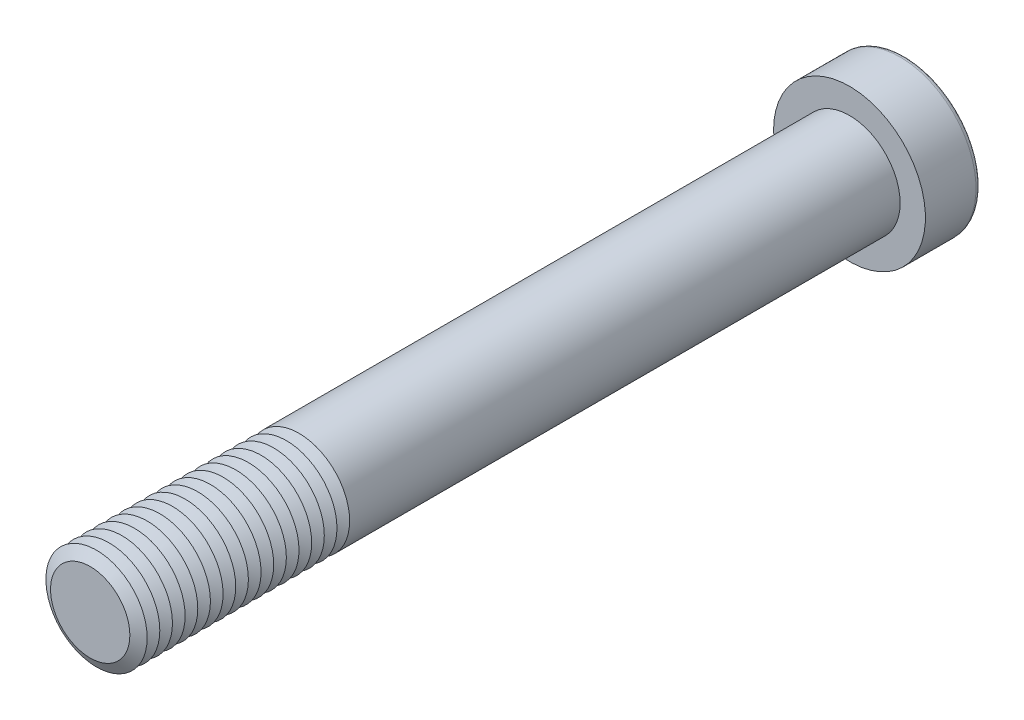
ISO-10303-21;
HEADER;
FILE_DESCRIPTION(('STEP AP214'),'2;1');
FILE_NAME('part.step','',(''),(''),'','','');
FILE_SCHEMA(('AUTOMOTIVE_DESIGN { 1 0 10303 214 1 1 1 1 }'));
ENDSEC;
DATA;
#1=APPLICATION_CONTEXT('core data for automotive mechanical design processes');
#2=APPLICATION_PROTOCOL_DEFINITION('international standard','automotive_design',2000,#1);
#3=PRODUCT_CONTEXT('',#1,'mechanical');
#4=PRODUCT('Part','Part','',(#3));
#5=PRODUCT_RELATED_PRODUCT_CATEGORY('part','',(#4));
#6=PRODUCT_DEFINITION_FORMATION('','',#4);
#7=PRODUCT_DEFINITION_CONTEXT('part definition',#1,'design');
#8=PRODUCT_DEFINITION('design','',#6,#7);
#9=PRODUCT_DEFINITION_SHAPE('','',#8);
#10=(LENGTH_UNIT() NAMED_UNIT(*) SI_UNIT(.MILLI.,.METRE.));
#11=(NAMED_UNIT(*) PLANE_ANGLE_UNIT() SI_UNIT($,.RADIAN.));
#12=(NAMED_UNIT(*) SI_UNIT($,.STERADIAN.) SOLID_ANGLE_UNIT());
#13=UNCERTAINTY_MEASURE_WITH_UNIT(LENGTH_MEASURE(1.E-05),#10,'distance_accuracy_value','');
#14=(GEOMETRIC_REPRESENTATION_CONTEXT(3) GLOBAL_UNCERTAINTY_ASSIGNED_CONTEXT((#13)) GLOBAL_UNIT_ASSIGNED_CONTEXT((#10,
#11,#12)) REPRESENTATION_CONTEXT('',''));
#15=CARTESIAN_POINT('',(0.,0.,0.));
#16=DIRECTION('',(0.,0.,1.));
#17=DIRECTION('',(1.,0.,0.));
#18=AXIS2_PLACEMENT_3D('',#15,#16,#17);
#19=CARTESIAN_POINT('',(0.,0.,141.25));
#20=DIRECTION('',(0.,0.,1.));
#21=DIRECTION('',(1.,0.,0.));
#22=AXIS2_PLACEMENT_3D('',#19,#20,#21);
#23=CONICAL_SURFACE('',#22,10.,1.0471975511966);
#24=CARTESIAN_POINT('',(0.,0.,140.));
#25=DIRECTION('',(0.,0.,1.));
#26=DIRECTION('',(1.,0.,0.));
#27=AXIS2_PLACEMENT_3D('',#24,#25,#26);
#28=CIRCLE('',#27,7.8349364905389);
#29=CARTESIAN_POINT('',(7.8349364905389,0.,140.));
#30=VERTEX_POINT('',#29);
#31=EDGE_CURVE('E314',#30,#30,#28,.T.);
#32=ORIENTED_EDGE('',*,*,#31,.T.);
#33=EDGE_LOOP('',(#32));
#34=FACE_BOUND('',#33,.T.);
#35=CARTESIAN_POINT('',(0.,0.,141.25));
#36=DIRECTION('',(0.,0.,1.));
#37=DIRECTION('',(1.,0.,0.));
#38=AXIS2_PLACEMENT_3D('',#35,#36,#37);
#39=CIRCLE('',#38,10.);
#40=CARTESIAN_POINT('',(10.,0.,141.25));
#41=VERTEX_POINT('',#40);
#42=EDGE_CURVE('E317',#41,#41,#39,.T.);
#43=ORIENTED_EDGE('',*,*,#42,.F.);
#44=EDGE_LOOP('',(#43));
#45=FACE_BOUND('',#44,.T.);
#46=ADVANCED_FACE('F39',(#34,#45),#23,.T.);
#47=CARTESIAN_POINT('',(0.,0.,140.));
#48=DIRECTION('',(0.,0.,-1.));
#49=DIRECTION('',(-1.,0.,0.));
#50=AXIS2_PLACEMENT_3D('',#47,#48,#49);
#51=CONICAL_SURFACE('',#50,7.8349364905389,1.0471975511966);
#52=CARTESIAN_POINT('',(0.,0.,138.75));
#53=DIRECTION('',(0.,0.,1.));
#54=DIRECTION('',(1.,0.,0.));
#55=AXIS2_PLACEMENT_3D('',#52,#53,#54);
#56=CIRCLE('',#55,10.);
#57=CARTESIAN_POINT('',(10.,0.,138.75));
#58=VERTEX_POINT('',#57);
#59=EDGE_CURVE('E325',#58,#58,#56,.T.);
#60=ORIENTED_EDGE('',*,*,#59,.T.);
#61=EDGE_LOOP('',(#60));
#62=FACE_BOUND('',#61,.T.);
#63=ORIENTED_EDGE('',*,*,#31,.F.);
#64=EDGE_LOOP('',(#63));
#65=FACE_BOUND('',#64,.T.);
#66=ADVANCED_FACE('F245',(#62,#65),#51,.T.);
#67=CARTESIAN_POINT('',(0.,0.,150.));
#68=DIRECTION('',(0.,0.,1.));
#69=DIRECTION('',(1.,0.,0.));
#70=AXIS2_PLACEMENT_3D('',#67,#68,#69);
#71=PLANE('',#70);
#72=CARTESIAN_POINT('',(0.,0.,150.));
#73=DIRECTION('',(0.,0.,1.));
#74=DIRECTION('',(1.,0.,0.));
#75=AXIS2_PLACEMENT_3D('',#72,#73,#74);
#76=CIRCLE('',#75,7.8349364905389);
#77=CARTESIAN_POINT('',(7.8349364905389,0.,150.));
#78=VERTEX_POINT('',#77);
#79=EDGE_CURVE('E174',#78,#78,#76,.T.);
#80=ORIENTED_EDGE('',*,*,#79,.T.);
#81=EDGE_LOOP('',(#80));
#82=FACE_BOUND('',#81,.T.);
#83=ADVANCED_FACE('F251',(#82),#71,.T.);
#84=CARTESIAN_POINT('',(0.,0.,150.));
#85=DIRECTION('',(0.,0.,-1.));
#86=DIRECTION('',(-1.,0.,0.));
#87=AXIS2_PLACEMENT_3D('',#84,#85,#86);
#88=CONICAL_SURFACE('',#87,7.8349364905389,1.0471975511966);
#89=CARTESIAN_POINT('',(0.,0.,148.75));
#90=DIRECTION('',(0.,0.,1.));
#91=DIRECTION('',(1.,0.,0.));
#92=AXIS2_PLACEMENT_3D('',#89,#90,#91);
#93=CIRCLE('',#92,10.);
#94=CARTESIAN_POINT('',(10.,0.,148.75));
#95=VERTEX_POINT('',#94);
#96=EDGE_CURVE('E291',#95,#95,#93,.T.);
#97=ORIENTED_EDGE('',*,*,#96,.T.);
#98=EDGE_LOOP('',(#97));
#99=FACE_BOUND('',#98,.T.);
#100=ORIENTED_EDGE('',*,*,#79,.F.);
#101=EDGE_LOOP('',(#100));
#102=FACE_BOUND('',#101,.T.);
#103=ADVANCED_FACE('F199',(#99,#102),#88,.T.);
#104=CARTESIAN_POINT('',(0.,0.,148.75));
#105=DIRECTION('',(0.,0.,1.));
#106=DIRECTION('',(1.,0.,0.));
#107=AXIS2_PLACEMENT_3D('',#104,#105,#106);
#108=CONICAL_SURFACE('',#107,10.,1.0471975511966);
#109=CARTESIAN_POINT('',(0.,0.,147.5));
#110=DIRECTION('',(0.,0.,1.));
#111=DIRECTION('',(1.,0.,0.));
#112=AXIS2_PLACEMENT_3D('',#109,#110,#111);
#113=CIRCLE('',#112,7.8349364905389);
#114=CARTESIAN_POINT('',(7.8349364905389,0.,147.5));
#115=VERTEX_POINT('',#114);
#116=EDGE_CURVE('E288',#115,#115,#113,.T.);
#117=ORIENTED_EDGE('',*,*,#116,.T.);
#118=EDGE_LOOP('',(#117));
#119=FACE_BOUND('',#118,.T.);
#120=ORIENTED_EDGE('',*,*,#96,.F.);
#121=EDGE_LOOP('',(#120));
#122=FACE_BOUND('',#121,.T.);
#123=ADVANCED_FACE('F277',(#119,#122),#108,.T.);
#124=CARTESIAN_POINT('',(0.,0.,147.5));
#125=DIRECTION('',(0.,0.,-1.));
#126=DIRECTION('',(-1.,0.,0.));
#127=AXIS2_PLACEMENT_3D('',#124,#125,#126);
#128=CONICAL_SURFACE('',#127,7.8349364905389,1.0471975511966);
#129=CARTESIAN_POINT('',(0.,0.,146.25));
#130=DIRECTION('',(0.,0.,1.));
#131=DIRECTION('',(1.,0.,0.));
#132=AXIS2_PLACEMENT_3D('',#129,#130,#131);
#133=CIRCLE('',#132,10.);
#134=CARTESIAN_POINT('',(10.,0.,146.25));
#135=VERTEX_POINT('',#134);
#136=EDGE_CURVE('E300',#135,#135,#133,.T.);
#137=ORIENTED_EDGE('',*,*,#136,.T.);
#138=EDGE_LOOP('',(#137));
#139=FACE_BOUND('',#138,.T.);
#140=ORIENTED_EDGE('',*,*,#116,.F.);
#141=EDGE_LOOP('',(#140));
#142=FACE_BOUND('',#141,.T.);
#143=ADVANCED_FACE('F274',(#139,#142),#128,.T.);
#144=CARTESIAN_POINT('',(0.,0.,146.25));
#145=DIRECTION('',(0.,0.,1.));
#146=DIRECTION('',(1.,0.,0.));
#147=AXIS2_PLACEMENT_3D('',#144,#145,#146);
#148=CONICAL_SURFACE('',#147,10.,1.0471975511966);
#149=CARTESIAN_POINT('',(0.,0.,145.));
#150=DIRECTION('',(0.,0.,1.));
#151=DIRECTION('',(1.,0.,0.));
#152=AXIS2_PLACEMENT_3D('',#149,#150,#151);
#153=CIRCLE('',#152,7.8349364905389);
#154=CARTESIAN_POINT('',(7.8349364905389,0.,145.));
#155=VERTEX_POINT('',#154);
#156=EDGE_CURVE('E293',#155,#155,#153,.T.);
#157=ORIENTED_EDGE('',*,*,#156,.T.);
#158=EDGE_LOOP('',(#157));
#159=FACE_BOUND('',#158,.T.);
#160=ORIENTED_EDGE('',*,*,#136,.F.);
#161=EDGE_LOOP('',(#160));
#162=FACE_BOUND('',#161,.T.);
#163=ADVANCED_FACE('F270',(#159,#162),#148,.T.);
#164=CARTESIAN_POINT('',(0.,0.,145.));
#165=DIRECTION('',(0.,0.,-1.));
#166=DIRECTION('',(-1.,0.,0.));
#167=AXIS2_PLACEMENT_3D('',#164,#165,#166);
#168=CONICAL_SURFACE('',#167,7.8349364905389,1.0471975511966);
#169=CARTESIAN_POINT('',(0.,0.,143.75));
#170=DIRECTION('',(0.,0.,1.));
#171=DIRECTION('',(1.,0.,0.));
#172=AXIS2_PLACEMENT_3D('',#169,#170,#171);
#173=CIRCLE('',#172,10.);
#174=CARTESIAN_POINT('',(10.,0.,143.75));
#175=VERTEX_POINT('',#174);
#176=EDGE_CURVE('E310',#175,#175,#173,.T.);
#177=ORIENTED_EDGE('',*,*,#176,.T.);
#178=EDGE_LOOP('',(#177));
#179=FACE_BOUND('',#178,.T.);
#180=ORIENTED_EDGE('',*,*,#156,.F.);
#181=EDGE_LOOP('',(#180));
#182=FACE_BOUND('',#181,.T.);
#183=ADVANCED_FACE('F266',(#179,#182),#168,.T.);
#184=CARTESIAN_POINT('',(0.,0.,143.75));
#185=DIRECTION('',(0.,0.,1.));
#186=DIRECTION('',(1.,0.,0.));
#187=AXIS2_PLACEMENT_3D('',#184,#185,#186);
#188=CONICAL_SURFACE('',#187,10.,1.0471975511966);
#189=CARTESIAN_POINT('',(0.,0.,142.5));
#190=DIRECTION('',(0.,0.,1.));
#191=DIRECTION('',(1.,0.,0.));
#192=AXIS2_PLACEMENT_3D('',#189,#190,#191);
#193=CIRCLE('',#192,7.8349364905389);
#194=CARTESIAN_POINT('',(7.8349364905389,0.,142.5));
#195=VERTEX_POINT('',#194);
#196=EDGE_CURVE('E306',#195,#195,#193,.T.);
#197=ORIENTED_EDGE('',*,*,#196,.T.);
#198=EDGE_LOOP('',(#197));
#199=FACE_BOUND('',#198,.T.);
#200=ORIENTED_EDGE('',*,*,#176,.F.);
#201=EDGE_LOOP('',(#200));
#202=FACE_BOUND('',#201,.T.);
#203=ADVANCED_FACE('F262',(#199,#202),#188,.T.);
#204=CARTESIAN_POINT('',(0.,0.,142.5));
#205=DIRECTION('',(0.,0.,-1.));
#206=DIRECTION('',(-1.,0.,0.));
#207=AXIS2_PLACEMENT_3D('',#204,#205,#206);
#208=CONICAL_SURFACE('',#207,7.8349364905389,1.0471975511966);
#209=ORIENTED_EDGE('',*,*,#42,.T.);
#210=EDGE_LOOP('',(#209));
#211=FACE_BOUND('',#210,.T.);
#212=ORIENTED_EDGE('',*,*,#196,.F.);
#213=EDGE_LOOP('',(#212));
#214=FACE_BOUND('',#213,.T.);
#215=ADVANCED_FACE('F258',(#211,#214),#208,.T.);
#216=CARTESIAN_POINT('',(0.,0.,138.75));
#217=DIRECTION('',(0.,0.,1.));
#218=DIRECTION('',(1.,0.,0.));
#219=AXIS2_PLACEMENT_3D('',#216,#217,#218);
#220=CONICAL_SURFACE('',#219,10.,1.0471975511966);
#221=CARTESIAN_POINT('',(0.,0.,137.5));
#222=DIRECTION('',(0.,0.,1.));
#223=DIRECTION('',(1.,0.,0.));
#224=AXIS2_PLACEMENT_3D('',#221,#222,#223);
#225=CIRCLE('',#224,7.8349364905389);
#226=CARTESIAN_POINT('',(7.8349364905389,0.,137.5));
#227=VERTEX_POINT('',#226);
#228=EDGE_CURVE('E321',#227,#227,#225,.T.);
#229=ORIENTED_EDGE('',*,*,#228,.T.);
#230=EDGE_LOOP('',(#229));
#231=FACE_BOUND('',#230,.T.);
#232=ORIENTED_EDGE('',*,*,#59,.F.);
#233=EDGE_LOOP('',(#232));
#234=FACE_BOUND('',#233,.T.);
#235=ADVANCED_FACE('F261',(#231,#234),#220,.T.);
#236=CARTESIAN_POINT('',(0.,0.,137.5));
#237=DIRECTION('',(0.,0.,-1.));
#238=DIRECTION('',(-1.,0.,0.));
#239=AXIS2_PLACEMENT_3D('',#236,#237,#238);
#240=CONICAL_SURFACE('',#239,7.8349364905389,1.0471975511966);
#241=CARTESIAN_POINT('',(0.,0.,136.25));
#242=DIRECTION('',(0.,0.,1.));
#243=DIRECTION('',(1.,0.,0.));
#244=AXIS2_PLACEMENT_3D('',#241,#242,#243);
#245=CIRCLE('',#244,10.);
#246=CARTESIAN_POINT('',(10.,0.,136.25));
#247=VERTEX_POINT('',#246);
#248=EDGE_CURVE('E332',#247,#247,#245,.T.);
#249=ORIENTED_EDGE('',*,*,#248,.T.);
#250=EDGE_LOOP('',(#249));
#251=FACE_BOUND('',#250,.T.);
#252=ORIENTED_EDGE('',*,*,#228,.F.);
#253=EDGE_LOOP('',(#252));
#254=FACE_BOUND('',#253,.T.);
#255=ADVANCED_FACE('F510',(#251,#254),#240,.T.);
#256=CARTESIAN_POINT('',(0.,0.,136.25));
#257=DIRECTION('',(0.,0.,1.));
#258=DIRECTION('',(1.,0.,0.));
#259=AXIS2_PLACEMENT_3D('',#256,#257,#258);
#260=CONICAL_SURFACE('',#259,10.,1.0471975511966);
#261=CARTESIAN_POINT('',(0.,0.,135.));
#262=DIRECTION('',(0.,0.,1.));
#263=DIRECTION('',(1.,0.,0.));
#264=AXIS2_PLACEMENT_3D('',#261,#262,#263);
#265=CIRCLE('',#264,7.8349364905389);
#266=CARTESIAN_POINT('',(7.8349364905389,0.,135.));
#267=VERTEX_POINT('',#266);
#268=EDGE_CURVE('E329',#267,#267,#265,.T.);
#269=ORIENTED_EDGE('',*,*,#268,.T.);
#270=EDGE_LOOP('',(#269));
#271=FACE_BOUND('',#270,.T.);
#272=ORIENTED_EDGE('',*,*,#248,.F.);
#273=EDGE_LOOP('',(#272));
#274=FACE_BOUND('',#273,.T.);
#275=ADVANCED_FACE('F506',(#271,#274),#260,.T.);
#276=CARTESIAN_POINT('',(0.,0.,135.));
#277=DIRECTION('',(0.,0.,-1.));
#278=DIRECTION('',(-1.,0.,0.));
#279=AXIS2_PLACEMENT_3D('',#276,#277,#278);
#280=CONICAL_SURFACE('',#279,7.8349364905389,1.0471975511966);
#281=CARTESIAN_POINT('',(0.,0.,133.75));
#282=DIRECTION('',(0.,0.,1.));
#283=DIRECTION('',(1.,0.,0.));
#284=AXIS2_PLACEMENT_3D('',#281,#282,#283);
#285=CIRCLE('',#284,10.);
#286=CARTESIAN_POINT('',(10.,0.,133.75));
#287=VERTEX_POINT('',#286);
#288=EDGE_CURVE('E340',#287,#287,#285,.T.);
#289=ORIENTED_EDGE('',*,*,#288,.T.);
#290=EDGE_LOOP('',(#289));
#291=FACE_BOUND('',#290,.T.);
#292=ORIENTED_EDGE('',*,*,#268,.F.);
#293=EDGE_LOOP('',(#292));
#294=FACE_BOUND('',#293,.T.);
#295=ADVANCED_FACE('F502',(#291,#294),#280,.T.);
#296=CARTESIAN_POINT('',(0.,0.,133.75));
#297=DIRECTION('',(0.,0.,1.));
#298=DIRECTION('',(1.,0.,0.));
#299=AXIS2_PLACEMENT_3D('',#296,#297,#298);
#300=CONICAL_SURFACE('',#299,10.,1.0471975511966);
#301=CARTESIAN_POINT('',(0.,0.,132.5));
#302=DIRECTION('',(0.,0.,1.));
#303=DIRECTION('',(1.,0.,0.));
#304=AXIS2_PLACEMENT_3D('',#301,#302,#303);
#305=CIRCLE('',#304,7.8349364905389);
#306=CARTESIAN_POINT('',(7.8349364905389,0.,132.5));
#307=VERTEX_POINT('',#306);
#308=EDGE_CURVE('E336',#307,#307,#305,.T.);
#309=ORIENTED_EDGE('',*,*,#308,.T.);
#310=EDGE_LOOP('',(#309));
#311=FACE_BOUND('',#310,.T.);
#312=ORIENTED_EDGE('',*,*,#288,.F.);
#313=EDGE_LOOP('',(#312));
#314=FACE_BOUND('',#313,.T.);
#315=ADVANCED_FACE('F498',(#311,#314),#300,.T.);
#316=CARTESIAN_POINT('',(0.,0.,132.5));
#317=DIRECTION('',(0.,0.,-1.));
#318=DIRECTION('',(-1.,0.,0.));
#319=AXIS2_PLACEMENT_3D('',#316,#317,#318);
#320=CONICAL_SURFACE('',#319,7.8349364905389,1.0471975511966);
#321=CARTESIAN_POINT('',(0.,0.,131.25));
#322=DIRECTION('',(0.,0.,1.));
#323=DIRECTION('',(1.,0.,0.));
#324=AXIS2_PLACEMENT_3D('',#321,#322,#323);
#325=CIRCLE('',#324,10.);
#326=CARTESIAN_POINT('',(10.,0.,131.25));
#327=VERTEX_POINT('',#326);
#328=EDGE_CURVE('E348',#327,#327,#325,.T.);
#329=ORIENTED_EDGE('',*,*,#328,.T.);
#330=EDGE_LOOP('',(#329));
#331=FACE_BOUND('',#330,.T.);
#332=ORIENTED_EDGE('',*,*,#308,.F.);
#333=EDGE_LOOP('',(#332));
#334=FACE_BOUND('',#333,.T.);
#335=ADVANCED_FACE('F494',(#331,#334),#320,.T.);
#336=CARTESIAN_POINT('',(0.,0.,131.25));
#337=DIRECTION('',(0.,0.,1.));
#338=DIRECTION('',(1.,0.,0.));
#339=AXIS2_PLACEMENT_3D('',#336,#337,#338);
#340=CONICAL_SURFACE('',#339,10.,1.0471975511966);
#341=CARTESIAN_POINT('',(0.,0.,130.));
#342=DIRECTION('',(0.,0.,1.));
#343=DIRECTION('',(1.,0.,0.));
#344=AXIS2_PLACEMENT_3D('',#341,#342,#343);
#345=CIRCLE('',#344,7.8349364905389);
#346=CARTESIAN_POINT('',(7.8349364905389,0.,130.));
#347=VERTEX_POINT('',#346);
#348=EDGE_CURVE('E344',#347,#347,#345,.T.);
#349=ORIENTED_EDGE('',*,*,#348,.T.);
#350=EDGE_LOOP('',(#349));
#351=FACE_BOUND('',#350,.T.);
#352=ORIENTED_EDGE('',*,*,#328,.F.);
#353=EDGE_LOOP('',(#352));
#354=FACE_BOUND('',#353,.T.);
#355=ADVANCED_FACE('F490',(#351,#354),#340,.T.);
#356=CARTESIAN_POINT('',(0.,0.,130.));
#357=DIRECTION('',(0.,0.,-1.));
#358=DIRECTION('',(-1.,0.,0.));
#359=AXIS2_PLACEMENT_3D('',#356,#357,#358);
#360=CONICAL_SURFACE('',#359,7.8349364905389,1.0471975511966);
#361=CARTESIAN_POINT('',(0.,0.,128.75));
#362=DIRECTION('',(0.,0.,1.));
#363=DIRECTION('',(1.,0.,0.));
#364=AXIS2_PLACEMENT_3D('',#361,#362,#363);
#365=CIRCLE('',#364,10.);
#366=CARTESIAN_POINT('',(10.,0.,128.75));
#367=VERTEX_POINT('',#366);
#368=EDGE_CURVE('E355',#367,#367,#365,.T.);
#369=ORIENTED_EDGE('',*,*,#368,.T.);
#370=EDGE_LOOP('',(#369));
#371=FACE_BOUND('',#370,.T.);
#372=ORIENTED_EDGE('',*,*,#348,.F.);
#373=EDGE_LOOP('',(#372));
#374=FACE_BOUND('',#373,.T.);
#375=ADVANCED_FACE('F486',(#371,#374),#360,.T.);
#376=CARTESIAN_POINT('',(0.,0.,128.75));
#377=DIRECTION('',(0.,0.,1.));
#378=DIRECTION('',(1.,0.,0.));
#379=AXIS2_PLACEMENT_3D('',#376,#377,#378);
#380=CONICAL_SURFACE('',#379,10.,1.0471975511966);
#381=CARTESIAN_POINT('',(0.,0.,127.5));
#382=DIRECTION('',(0.,0.,1.));
#383=DIRECTION('',(1.,0.,0.));
#384=AXIS2_PLACEMENT_3D('',#381,#382,#383);
#385=CIRCLE('',#384,7.8349364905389);
#386=CARTESIAN_POINT('',(7.8349364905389,0.,127.5));
#387=VERTEX_POINT('',#386);
#388=EDGE_CURVE('E352',#387,#387,#385,.T.);
#389=ORIENTED_EDGE('',*,*,#388,.T.);
#390=EDGE_LOOP('',(#389));
#391=FACE_BOUND('',#390,.T.);
#392=ORIENTED_EDGE('',*,*,#368,.F.);
#393=EDGE_LOOP('',(#392));
#394=FACE_BOUND('',#393,.T.);
#395=ADVANCED_FACE('F482',(#391,#394),#380,.T.);
#396=CARTESIAN_POINT('',(0.,0.,127.5));
#397=DIRECTION('',(0.,0.,-1.));
#398=DIRECTION('',(-1.,0.,0.));
#399=AXIS2_PLACEMENT_3D('',#396,#397,#398);
#400=CONICAL_SURFACE('',#399,7.8349364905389,1.0471975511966);
#401=CARTESIAN_POINT('',(0.,0.,126.25));
#402=DIRECTION('',(0.,0.,1.));
#403=DIRECTION('',(1.,0.,0.));
#404=AXIS2_PLACEMENT_3D('',#401,#402,#403);
#405=CIRCLE('',#404,10.);
#406=CARTESIAN_POINT('',(10.,0.,126.25));
#407=VERTEX_POINT('',#406);
#408=EDGE_CURVE('E363',#407,#407,#405,.T.);
#409=ORIENTED_EDGE('',*,*,#408,.T.);
#410=EDGE_LOOP('',(#409));
#411=FACE_BOUND('',#410,.T.);
#412=ORIENTED_EDGE('',*,*,#388,.F.);
#413=EDGE_LOOP('',(#412));
#414=FACE_BOUND('',#413,.T.);
#415=ADVANCED_FACE('F478',(#411,#414),#400,.T.);
#416=CARTESIAN_POINT('',(0.,0.,126.25));
#417=DIRECTION('',(0.,0.,1.));
#418=DIRECTION('',(1.,0.,0.));
#419=AXIS2_PLACEMENT_3D('',#416,#417,#418);
#420=CONICAL_SURFACE('',#419,10.,1.0471975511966);
#421=CARTESIAN_POINT('',(0.,0.,125.));
#422=DIRECTION('',(0.,0.,1.));
#423=DIRECTION('',(1.,0.,0.));
#424=AXIS2_PLACEMENT_3D('',#421,#422,#423);
#425=CIRCLE('',#424,7.8349364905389);
#426=CARTESIAN_POINT('',(7.8349364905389,0.,125.));
#427=VERTEX_POINT('',#426);
#428=EDGE_CURVE('E359',#427,#427,#425,.T.);
#429=ORIENTED_EDGE('',*,*,#428,.T.);
#430=EDGE_LOOP('',(#429));
#431=FACE_BOUND('',#430,.T.);
#432=ORIENTED_EDGE('',*,*,#408,.F.);
#433=EDGE_LOOP('',(#432));
#434=FACE_BOUND('',#433,.T.);
#435=ADVANCED_FACE('F474',(#431,#434),#420,.T.);
#436=CARTESIAN_POINT('',(0.,0.,125.));
#437=DIRECTION('',(0.,0.,-1.));
#438=DIRECTION('',(-1.,0.,0.));
#439=AXIS2_PLACEMENT_3D('',#436,#437,#438);
#440=CONICAL_SURFACE('',#439,7.8349364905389,1.0471975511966);
#441=CARTESIAN_POINT('',(0.,0.,123.75));
#442=DIRECTION('',(0.,0.,1.));
#443=DIRECTION('',(1.,0.,0.));
#444=AXIS2_PLACEMENT_3D('',#441,#442,#443);
#445=CIRCLE('',#444,10.);
#446=CARTESIAN_POINT('',(10.,0.,123.75));
#447=VERTEX_POINT('',#446);
#448=EDGE_CURVE('E371',#447,#447,#445,.T.);
#449=ORIENTED_EDGE('',*,*,#448,.T.);
#450=EDGE_LOOP('',(#449));
#451=FACE_BOUND('',#450,.T.);
#452=ORIENTED_EDGE('',*,*,#428,.F.);
#453=EDGE_LOOP('',(#452));
#454=FACE_BOUND('',#453,.T.);
#455=ADVANCED_FACE('F470',(#451,#454),#440,.T.);
#456=CARTESIAN_POINT('',(0.,0.,123.75));
#457=DIRECTION('',(0.,0.,1.));
#458=DIRECTION('',(1.,0.,0.));
#459=AXIS2_PLACEMENT_3D('',#456,#457,#458);
#460=CONICAL_SURFACE('',#459,10.,1.0471975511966);
#461=CARTESIAN_POINT('',(0.,0.,122.5));
#462=DIRECTION('',(0.,0.,1.));
#463=DIRECTION('',(1.,0.,0.));
#464=AXIS2_PLACEMENT_3D('',#461,#462,#463);
#465=CIRCLE('',#464,7.8349364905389);
#466=CARTESIAN_POINT('',(7.8349364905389,0.,122.5));
#467=VERTEX_POINT('',#466);
#468=EDGE_CURVE('E367',#467,#467,#465,.T.);
#469=ORIENTED_EDGE('',*,*,#468,.T.);
#470=EDGE_LOOP('',(#469));
#471=FACE_BOUND('',#470,.T.);
#472=ORIENTED_EDGE('',*,*,#448,.F.);
#473=EDGE_LOOP('',(#472));
#474=FACE_BOUND('',#473,.T.);
#475=ADVANCED_FACE('F466',(#471,#474),#460,.T.);
#476=CARTESIAN_POINT('',(0.,0.,122.5));
#477=DIRECTION('',(0.,0.,-1.));
#478=DIRECTION('',(-1.,0.,0.));
#479=AXIS2_PLACEMENT_3D('',#476,#477,#478);
#480=CONICAL_SURFACE('',#479,7.8349364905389,1.0471975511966);
#481=CARTESIAN_POINT('',(0.,0.,121.25));
#482=DIRECTION('',(0.,0.,1.));
#483=DIRECTION('',(1.,0.,0.));
#484=AXIS2_PLACEMENT_3D('',#481,#482,#483);
#485=CIRCLE('',#484,10.);
#486=CARTESIAN_POINT('',(10.,0.,121.25));
#487=VERTEX_POINT('',#486);
#488=EDGE_CURVE('E379',#487,#487,#485,.T.);
#489=ORIENTED_EDGE('',*,*,#488,.T.);
#490=EDGE_LOOP('',(#489));
#491=FACE_BOUND('',#490,.T.);
#492=ORIENTED_EDGE('',*,*,#468,.F.);
#493=EDGE_LOOP('',(#492));
#494=FACE_BOUND('',#493,.T.);
#495=ADVANCED_FACE('F462',(#491,#494),#480,.T.);
#496=CARTESIAN_POINT('',(0.,0.,121.25));
#497=DIRECTION('',(0.,0.,1.));
#498=DIRECTION('',(1.,0.,0.));
#499=AXIS2_PLACEMENT_3D('',#496,#497,#498);
#500=CONICAL_SURFACE('',#499,10.,1.0471975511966);
#501=CARTESIAN_POINT('',(0.,0.,120.));
#502=DIRECTION('',(0.,0.,1.));
#503=DIRECTION('',(1.,0.,0.));
#504=AXIS2_PLACEMENT_3D('',#501,#502,#503);
#505=CIRCLE('',#504,7.8349364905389);
#506=CARTESIAN_POINT('',(7.8349364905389,0.,120.));
#507=VERTEX_POINT('',#506);
#508=EDGE_CURVE('E375',#507,#507,#505,.T.);
#509=ORIENTED_EDGE('',*,*,#508,.T.);
#510=EDGE_LOOP('',(#509));
#511=FACE_BOUND('',#510,.T.);
#512=ORIENTED_EDGE('',*,*,#488,.F.);
#513=EDGE_LOOP('',(#512));
#514=FACE_BOUND('',#513,.T.);
#515=ADVANCED_FACE('F458',(#511,#514),#500,.T.);
#516=CARTESIAN_POINT('',(0.,0.,120.));
#517=DIRECTION('',(0.,0.,-1.));
#518=DIRECTION('',(-1.,0.,0.));
#519=AXIS2_PLACEMENT_3D('',#516,#517,#518);
#520=CONICAL_SURFACE('',#519,7.8349364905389,1.0471975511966);
#521=CARTESIAN_POINT('',(0.,0.,118.75));
#522=DIRECTION('',(0.,0.,1.));
#523=DIRECTION('',(1.,0.,0.));
#524=AXIS2_PLACEMENT_3D('',#521,#522,#523);
#525=CIRCLE('',#524,10.);
#526=CARTESIAN_POINT('',(10.,0.,118.75));
#527=VERTEX_POINT('',#526);
#528=EDGE_CURVE('E387',#527,#527,#525,.T.);
#529=ORIENTED_EDGE('',*,*,#528,.T.);
#530=EDGE_LOOP('',(#529));
#531=FACE_BOUND('',#530,.T.);
#532=ORIENTED_EDGE('',*,*,#508,.F.);
#533=EDGE_LOOP('',(#532));
#534=FACE_BOUND('',#533,.T.);
#535=ADVANCED_FACE('F454',(#531,#534),#520,.T.);
#536=CARTESIAN_POINT('',(0.,0.,118.75));
#537=DIRECTION('',(0.,0.,1.));
#538=DIRECTION('',(1.,0.,0.));
#539=AXIS2_PLACEMENT_3D('',#536,#537,#538);
#540=CONICAL_SURFACE('',#539,10.,1.0471975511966);
#541=CARTESIAN_POINT('',(0.,0.,117.5));
#542=DIRECTION('',(0.,0.,1.));
#543=DIRECTION('',(1.,0.,0.));
#544=AXIS2_PLACEMENT_3D('',#541,#542,#543);
#545=CIRCLE('',#544,7.8349364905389);
#546=CARTESIAN_POINT('',(7.8349364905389,0.,117.5));
#547=VERTEX_POINT('',#546);
#548=EDGE_CURVE('E383',#547,#547,#545,.T.);
#549=ORIENTED_EDGE('',*,*,#548,.T.);
#550=EDGE_LOOP('',(#549));
#551=FACE_BOUND('',#550,.T.);
#552=ORIENTED_EDGE('',*,*,#528,.F.);
#553=EDGE_LOOP('',(#552));
#554=FACE_BOUND('',#553,.T.);
#555=ADVANCED_FACE('F450',(#551,#554),#540,.T.);
#556=CARTESIAN_POINT('',(0.,0.,117.5));
#557=DIRECTION('',(0.,0.,-1.));
#558=DIRECTION('',(-1.,0.,0.));
#559=AXIS2_PLACEMENT_3D('',#556,#557,#558);
#560=CONICAL_SURFACE('',#559,7.8349364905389,1.0471975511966);
#561=CARTESIAN_POINT('',(0.,0.,116.25));
#562=DIRECTION('',(0.,0.,1.));
#563=DIRECTION('',(1.,0.,0.));
#564=AXIS2_PLACEMENT_3D('',#561,#562,#563);
#565=CIRCLE('',#564,10.);
#566=CARTESIAN_POINT('',(10.,0.,116.25));
#567=VERTEX_POINT('',#566);
#568=EDGE_CURVE('E395',#567,#567,#565,.T.);
#569=ORIENTED_EDGE('',*,*,#568,.T.);
#570=EDGE_LOOP('',(#569));
#571=FACE_BOUND('',#570,.T.);
#572=ORIENTED_EDGE('',*,*,#548,.F.);
#573=EDGE_LOOP('',(#572));
#574=FACE_BOUND('',#573,.T.);
#575=ADVANCED_FACE('F446',(#571,#574),#560,.T.);
#576=CARTESIAN_POINT('',(0.,0.,116.25));
#577=DIRECTION('',(0.,0.,1.));
#578=DIRECTION('',(1.,0.,0.));
#579=AXIS2_PLACEMENT_3D('',#576,#577,#578);
#580=CONICAL_SURFACE('',#579,10.,1.0471975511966);
#581=CARTESIAN_POINT('',(0.,0.,115.));
#582=DIRECTION('',(0.,0.,1.));
#583=DIRECTION('',(1.,0.,0.));
#584=AXIS2_PLACEMENT_3D('',#581,#582,#583);
#585=CIRCLE('',#584,7.8349364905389);
#586=CARTESIAN_POINT('',(7.8349364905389,0.,115.));
#587=VERTEX_POINT('',#586);
#588=EDGE_CURVE('E391',#587,#587,#585,.T.);
#589=ORIENTED_EDGE('',*,*,#588,.T.);
#590=EDGE_LOOP('',(#589));
#591=FACE_BOUND('',#590,.T.);
#592=ORIENTED_EDGE('',*,*,#568,.F.);
#593=EDGE_LOOP('',(#592));
#594=FACE_BOUND('',#593,.T.);
#595=ADVANCED_FACE('F442',(#591,#594),#580,.T.);
#596=CARTESIAN_POINT('',(0.,0.,115.));
#597=DIRECTION('',(0.,0.,-1.));
#598=DIRECTION('',(-1.,0.,0.));
#599=AXIS2_PLACEMENT_3D('',#596,#597,#598);
#600=CONICAL_SURFACE('',#599,7.8349364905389,1.0471975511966);
#601=CARTESIAN_POINT('',(0.,0.,113.75));
#602=DIRECTION('',(0.,0.,1.));
#603=DIRECTION('',(1.,0.,0.));
#604=AXIS2_PLACEMENT_3D('',#601,#602,#603);
#605=CIRCLE('',#604,10.);
#606=CARTESIAN_POINT('',(10.,0.,113.75));
#607=VERTEX_POINT('',#606);
#608=EDGE_CURVE('E403',#607,#607,#605,.T.);
#609=ORIENTED_EDGE('',*,*,#608,.T.);
#610=EDGE_LOOP('',(#609));
#611=FACE_BOUND('',#610,.T.);
#612=ORIENTED_EDGE('',*,*,#588,.F.);
#613=EDGE_LOOP('',(#612));
#614=FACE_BOUND('',#613,.T.);
#615=ADVANCED_FACE('F438',(#611,#614),#600,.T.);
#616=CARTESIAN_POINT('',(0.,0.,113.75));
#617=DIRECTION('',(0.,0.,1.));
#618=DIRECTION('',(1.,0.,0.));
#619=AXIS2_PLACEMENT_3D('',#616,#617,#618);
#620=CONICAL_SURFACE('',#619,10.,1.0471975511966);
#621=CARTESIAN_POINT('',(0.,0.,112.5));
#622=DIRECTION('',(0.,0.,1.));
#623=DIRECTION('',(1.,0.,0.));
#624=AXIS2_PLACEMENT_3D('',#621,#622,#623);
#625=CIRCLE('',#624,7.8349364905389);
#626=CARTESIAN_POINT('',(7.8349364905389,0.,112.5));
#627=VERTEX_POINT('',#626);
#628=EDGE_CURVE('E399',#627,#627,#625,.T.);
#629=ORIENTED_EDGE('',*,*,#628,.T.);
#630=EDGE_LOOP('',(#629));
#631=FACE_BOUND('',#630,.T.);
#632=ORIENTED_EDGE('',*,*,#608,.F.);
#633=EDGE_LOOP('',(#632));
#634=FACE_BOUND('',#633,.T.);
#635=ADVANCED_FACE('F433',(#631,#634),#620,.T.);
#636=CARTESIAN_POINT('',(0.,0.,112.5));
#637=DIRECTION('',(0.,0.,-1.));
#638=DIRECTION('',(-1.,0.,0.));
#639=AXIS2_PLACEMENT_3D('',#636,#637,#638);
#640=CONICAL_SURFACE('',#639,7.8349364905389,1.0471975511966);
#641=CARTESIAN_POINT('',(0.,0.,111.25));
#642=DIRECTION('',(0.,0.,1.));
#643=DIRECTION('',(1.,0.,0.));
#644=AXIS2_PLACEMENT_3D('',#641,#642,#643);
#645=CIRCLE('',#644,10.);
#646=CARTESIAN_POINT('',(10.,0.,111.25));
#647=VERTEX_POINT('',#646);
#648=EDGE_CURVE('E415',#647,#647,#645,.T.);
#649=ORIENTED_EDGE('',*,*,#648,.T.);
#650=EDGE_LOOP('',(#649));
#651=FACE_BOUND('',#650,.T.);
#652=ORIENTED_EDGE('',*,*,#628,.F.);
#653=EDGE_LOOP('',(#652));
#654=FACE_BOUND('',#653,.T.);
#655=ADVANCED_FACE('F419',(#651,#654),#640,.T.);
#656=CARTESIAN_POINT('',(0.,0.,111.25));
#657=DIRECTION('',(0.,0.,1.));
#658=DIRECTION('',(1.,0.,0.));
#659=AXIS2_PLACEMENT_3D('',#656,#657,#658);
#660=CONICAL_SURFACE('',#659,10.,1.0471975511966);
#661=CARTESIAN_POINT('',(0.,0.,110.));
#662=DIRECTION('',(0.,0.,1.));
#663=DIRECTION('',(1.,0.,0.));
#664=AXIS2_PLACEMENT_3D('',#661,#662,#663);
#665=CIRCLE('',#664,7.8349364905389);
#666=CARTESIAN_POINT('',(7.8349364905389,0.,110.));
#667=VERTEX_POINT('',#666);
#668=EDGE_CURVE('E407',#667,#667,#665,.T.);
#669=ORIENTED_EDGE('',*,*,#668,.T.);
#670=EDGE_LOOP('',(#669));
#671=FACE_BOUND('',#670,.T.);
#672=ORIENTED_EDGE('',*,*,#648,.F.);
#673=EDGE_LOOP('',(#672));
#674=FACE_BOUND('',#673,.T.);
#675=ADVANCED_FACE('F422',(#671,#674),#660,.T.);
#676=CARTESIAN_POINT('',(0.,0.,110.));
#677=DIRECTION('',(0.,0.,-1.));
#678=DIRECTION('',(-1.,0.,0.));
#679=AXIS2_PLACEMENT_3D('',#676,#677,#678);
#680=CONICAL_SURFACE('',#679,7.8349364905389,1.0471975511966);
#681=CARTESIAN_POINT('',(0.,0.,108.75));
#682=DIRECTION('',(0.,0.,1.));
#683=DIRECTION('',(1.,0.,0.));
#684=AXIS2_PLACEMENT_3D('',#681,#682,#683);
#685=CIRCLE('',#684,10.);
#686=CARTESIAN_POINT('',(10.,0.,108.75));
#687=VERTEX_POINT('',#686);
#688=EDGE_CURVE('E411',#687,#687,#685,.T.);
#689=ORIENTED_EDGE('',*,*,#688,.T.);
#690=EDGE_LOOP('',(#689));
#691=FACE_BOUND('',#690,.T.);
#692=ORIENTED_EDGE('',*,*,#668,.F.);
#693=EDGE_LOOP('',(#692));
#694=FACE_BOUND('',#693,.T.);
#695=ADVANCED_FACE('F424',(#691,#694),#680,.T.);
#696=CARTESIAN_POINT('',(0.,0.,-0.499999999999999));
#697=DIRECTION('',(0.,0.,-1.));
#698=DIRECTION('',(-1.,0.,0.));
#699=AXIS2_PLACEMENT_3D('',#696,#697,#698);
#700=CONICAL_SURFACE('',#699,7.,1.0471975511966);
#701=CARTESIAN_POINT('',(0.,0.,3.54145188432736));
#702=VERTEX_POINT('',#701);
#703=VERTEX_LOOP('',#702);
#704=FACE_BOUND('',#703,.T.);
#705=CARTESIAN_POINT('',(0.,0.,-0.499999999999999));
#706=DIRECTION('',(0.,0.,-1.));
#707=DIRECTION('',(-1.,0.,0.));
#708=AXIS2_PLACEMENT_3D('',#705,#706,#707);
#709=CIRCLE('',#708,7.);
#710=CARTESIAN_POINT('',(-6.06217782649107,3.5,-0.499999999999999));
#711=VERTEX_POINT('',#710);
#712=CARTESIAN_POINT('',(0.,7.,-0.499999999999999));
#713=VERTEX_POINT('',#712);
#714=EDGE_CURVE('E149',#711,#713,#709,.T.);
#715=ORIENTED_EDGE('',*,*,#714,.T.);
#716=CARTESIAN_POINT('',(0.,0.,-0.499999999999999));
#717=DIRECTION('',(0.,0.,-1.));
#718=DIRECTION('',(-1.,0.,0.));
#719=AXIS2_PLACEMENT_3D('',#716,#717,#718);
#720=CIRCLE('',#719,7.);
#721=CARTESIAN_POINT('',(6.06217782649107,3.5,-0.499999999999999));
#722=VERTEX_POINT('',#721);
#723=EDGE_CURVE('E54',#713,#722,#720,.T.);
#724=ORIENTED_EDGE('',*,*,#723,.T.);
#725=CARTESIAN_POINT('',(6.06217782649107,-3.5,-0.499999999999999));
#726=VERTEX_POINT('',#725);
#727=EDGE_CURVE('E1025',#722,#726,#720,.T.);
#728=ORIENTED_EDGE('',*,*,#727,.T.);
#729=CARTESIAN_POINT('',(0.,-7.,-0.499999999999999));
#730=VERTEX_POINT('',#729);
#731=EDGE_CURVE('E1023',#726,#730,#720,.T.);
#732=ORIENTED_EDGE('',*,*,#731,.T.);
#733=CARTESIAN_POINT('',(-6.06217782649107,-3.5,-0.499999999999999));
#734=VERTEX_POINT('',#733);
#735=EDGE_CURVE('E1018',#730,#734,#720,.T.);
#736=ORIENTED_EDGE('',*,*,#735,.T.);
#737=EDGE_CURVE('E1016',#734,#711,#720,.T.);
#738=ORIENTED_EDGE('',*,*,#737,.T.);
#739=EDGE_LOOP('',(#715,#724,#728,#732,#736,#738));
#740=FACE_BOUND('',#739,.T.);
#741=ADVANCED_FACE('F201',(#704,#740),#700,.F.);
#742=CARTESIAN_POINT('',(0.,0.,-0.499999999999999));
#743=DIRECTION('',(0.,0.,-1.));
#744=DIRECTION('',(-1.,0.,0.));
#745=AXIS2_PLACEMENT_3D('',#742,#743,#744);
#746=PLANE('',#745);
#747=ORIENTED_EDGE('',*,*,#723,.F.);
#748=DIRECTION('',(1.,0.,0.));
#749=VECTOR('',#748,1.);
#750=CARTESIAN_POINT('',(-4.04145188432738,7.,-0.499999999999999));
#751=LINE('',#750,#749);
#752=CARTESIAN_POINT('',(4.04145188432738,7.,-0.499999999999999));
#753=VERTEX_POINT('',#752);
#754=EDGE_CURVE('E1070',#713,#753,#751,.T.);
#755=ORIENTED_EDGE('',*,*,#754,.T.);
#756=DIRECTION('',(0.5,-0.866025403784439,0.));
#757=VECTOR('',#756,1.);
#758=CARTESIAN_POINT('',(4.04145188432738,7.,-0.499999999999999));
#759=LINE('',#758,#757);
#760=EDGE_CURVE('E155',#753,#722,#759,.T.);
#761=ORIENTED_EDGE('',*,*,#760,.T.);
#762=EDGE_LOOP('',(#747,#755,#761));
#763=FACE_BOUND('',#762,.T.);
#764=ADVANCED_FACE('F605',(#763),#746,.T.);
#765=ORIENTED_EDGE('',*,*,#727,.F.);
#766=CARTESIAN_POINT('',(8.08290376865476,0.,-0.499999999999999));
#767=VERTEX_POINT('',#766);
#768=EDGE_CURVE('E1066',#722,#767,#759,.T.);
#769=ORIENTED_EDGE('',*,*,#768,.T.);
#770=DIRECTION('',(-0.5,-0.866025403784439,0.));
#771=VECTOR('',#770,1.);
#772=CARTESIAN_POINT('',(8.08290376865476,0.,-0.499999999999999));
#773=LINE('',#772,#771);
#774=EDGE_CURVE('E1040',#767,#726,#773,.T.);
#775=ORIENTED_EDGE('',*,*,#774,.T.);
#776=EDGE_LOOP('',(#765,#769,#775));
#777=FACE_BOUND('',#776,.T.);
#778=ADVANCED_FACE('F615',(#777),#746,.T.);
#779=ORIENTED_EDGE('',*,*,#731,.F.);
#780=CARTESIAN_POINT('',(4.04145188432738,-7.,-0.499999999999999));
#781=VERTEX_POINT('',#780);
#782=EDGE_CURVE('E1042',#726,#781,#773,.T.);
#783=ORIENTED_EDGE('',*,*,#782,.T.);
#784=DIRECTION('',(-1.,0.,0.));
#785=VECTOR('',#784,1.);
#786=CARTESIAN_POINT('',(4.04145188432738,-7.,-0.499999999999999));
#787=LINE('',#786,#785);
#788=EDGE_CURVE('E990',#781,#730,#787,.T.);
#789=ORIENTED_EDGE('',*,*,#788,.T.);
#790=EDGE_LOOP('',(#779,#783,#789));
#791=FACE_BOUND('',#790,.T.);
#792=ADVANCED_FACE('F625',(#791),#746,.T.);
#793=ORIENTED_EDGE('',*,*,#735,.F.);
#794=CARTESIAN_POINT('',(-4.04145188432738,-7.,-0.499999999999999));
#795=VERTEX_POINT('',#794);
#796=EDGE_CURVE('E1036',#730,#795,#787,.T.);
#797=ORIENTED_EDGE('',*,*,#796,.T.);
#798=DIRECTION('',(-0.5,0.866025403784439,0.));
#799=VECTOR('',#798,1.);
#800=CARTESIAN_POINT('',(-4.04145188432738,-7.,-0.499999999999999));
#801=LINE('',#800,#799);
#802=EDGE_CURVE('E1038',#795,#734,#801,.T.);
#803=ORIENTED_EDGE('',*,*,#802,.T.);
#804=EDGE_LOOP('',(#793,#797,#803));
#805=FACE_BOUND('',#804,.T.);
#806=ADVANCED_FACE('F633',(#805),#746,.T.);
#807=ORIENTED_EDGE('',*,*,#737,.F.);
#808=CARTESIAN_POINT('',(-8.08290376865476,0.,-0.499999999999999));
#809=VERTEX_POINT('',#808);
#810=EDGE_CURVE('E1044',#734,#809,#801,.T.);
#811=ORIENTED_EDGE('',*,*,#810,.T.);
#812=DIRECTION('',(0.5,0.866025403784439,0.));
#813=VECTOR('',#812,1.);
#814=CARTESIAN_POINT('',(-8.08290376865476,0.,-0.499999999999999));
#815=LINE('',#814,#813);
#816=EDGE_CURVE('E158',#809,#711,#815,.T.);
#817=ORIENTED_EDGE('',*,*,#816,.T.);
#818=EDGE_LOOP('',(#807,#811,#817));
#819=FACE_BOUND('',#818,.T.);
#820=ADVANCED_FACE('F231',(#819),#746,.T.);
#821=ORIENTED_EDGE('',*,*,#714,.F.);
#822=CARTESIAN_POINT('',(-4.04145188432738,7.,-0.499999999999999));
#823=VERTEX_POINT('',#822);
#824=EDGE_CURVE('E1050',#711,#823,#815,.T.);
#825=ORIENTED_EDGE('',*,*,#824,.T.);
#826=EDGE_CURVE('E1067',#823,#713,#751,.T.);
#827=ORIENTED_EDGE('',*,*,#826,.T.);
#828=EDGE_LOOP('',(#821,#825,#827));
#829=FACE_BOUND('',#828,.T.);
#830=ADVANCED_FACE('F617',(#829),#746,.T.);
#831=CARTESIAN_POINT('',(-4.04145188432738,7.,-0.499999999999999));
#832=DIRECTION('',(0.,1.,0.));
#833=DIRECTION('',(0.,0.,1.));
#834=AXIS2_PLACEMENT_3D('',#831,#832,#833);
#835=PLANE('',#834);
#836=DIRECTION('',(0.,0.,-1.));
#837=VECTOR('',#836,1.);
#838=CARTESIAN_POINT('',(-4.04145188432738,7.,-0.499999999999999));
#839=LINE('',#838,#837);
#840=CARTESIAN_POINT('',(-4.04145188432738,7.,-11.));
#841=VERTEX_POINT('',#840);
#842=EDGE_CURVE('E147',#823,#841,#839,.T.);
#843=ORIENTED_EDGE('',*,*,#842,.T.);
#844=CARTESIAN_POINT('',(-10.5504265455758,7.,-12.226809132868));
#845=CARTESIAN_POINT('',(-10.234342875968,7.,-12.1562549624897));
#846=CARTESIAN_POINT('',(-9.91805751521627,7.,-12.0865877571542));
#847=CARTESIAN_POINT('',(-9.28498462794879,7.,-11.9495060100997));
#848=CARTESIAN_POINT('',(-8.9681970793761,7.,-11.8820915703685));
#849=CARTESIAN_POINT('',(-8.3337216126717,7.,-11.7499322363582));
#850=CARTESIAN_POINT('',(-8.0160331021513,7.,-11.6851901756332));
#851=CARTESIAN_POINT('',(-7.37998429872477,7.,-11.5590967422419));
#852=CARTESIAN_POINT('',(-7.0616240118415,7.,-11.4977453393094));
#853=CARTESIAN_POINT('',(-6.42688035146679,7.,-11.3797520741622));
#854=CARTESIAN_POINT('',(-6.11050373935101,7.,-11.3230740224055));
#855=CARTESIAN_POINT('',(-5.47688007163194,7.,-11.214821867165));
#856=CARTESIAN_POINT('',(-5.15963303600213,7.,-11.1632476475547));
#857=CARTESIAN_POINT('',(-4.52422055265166,7.,-11.0663930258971));
#858=CARTESIAN_POINT('',(-4.20605525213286,7.,-11.0211116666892));
#859=CARTESIAN_POINT('',(-3.56871761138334,7.,-10.9382023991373));
#860=CARTESIAN_POINT('',(-3.24954527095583,7.,-10.9005744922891));
#861=CARTESIAN_POINT('',(-2.60663136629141,7.,-10.8340645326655));
#862=CARTESIAN_POINT('',(-2.28287891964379,7.,-10.8052860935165));
#863=CARTESIAN_POINT('',(-1.63459129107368,7.,-10.7584808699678));
#864=CARTESIAN_POINT('',(-1.31005612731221,7.,-10.7404538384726));
#865=CARTESIAN_POINT('',(-0.660675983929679,7.,-10.7162037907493));
#866=CARTESIAN_POINT('',(-0.335831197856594,7.,-10.7099756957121));
#867=CARTESIAN_POINT('',(0.313864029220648,7.,-10.7097025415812));
#868=CARTESIAN_POINT('',(0.638714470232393,7.,-10.7156575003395));
#869=CARTESIAN_POINT('',(1.2893045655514,7.,-10.7394217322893));
#870=CARTESIAN_POINT('',(1.61504241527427,7.,-10.7572794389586));
#871=CARTESIAN_POINT('',(2.26573386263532,7.,-10.8038495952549));
#872=CARTESIAN_POINT('',(2.5906874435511,7.,-10.8325622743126));
#873=CARTESIAN_POINT('',(3.23981909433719,7.,-10.8994274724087));
#874=CARTESIAN_POINT('',(3.56399652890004,7.,-10.9375860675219));
#875=CARTESIAN_POINT('',(4.2113121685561,7.,-11.0217977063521));
#876=CARTESIAN_POINT('',(4.53445037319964,7.,-11.0678507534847));
#877=CARTESIAN_POINT('',(5.18817201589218,7.,-11.1677070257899));
#878=CARTESIAN_POINT('',(5.51872906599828,7.,-11.221681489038));
#879=CARTESIAN_POINT('',(6.17890776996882,7.,-11.3351036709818));
#880=CARTESIAN_POINT('',(6.50852939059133,7.,-11.3945515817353));
#881=CARTESIAN_POINT('',(7.16699002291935,7.,-11.5178381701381));
#882=CARTESIAN_POINT('',(7.49582892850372,7.,-11.5816774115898));
#883=CARTESIAN_POINT('',(8.15279770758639,7.,-11.7128718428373));
#884=CARTESIAN_POINT('',(8.48092758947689,7.,-11.7802269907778));
#885=CARTESIAN_POINT('',(9.13669969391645,7.,-11.9177934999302));
#886=CARTESIAN_POINT('',(9.46434171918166,7.,-11.9880057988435));
#887=CARTESIAN_POINT('',(10.1191240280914,7.,-12.1307356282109));
#888=CARTESIAN_POINT('',(10.4462643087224,7.,-12.2032531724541));
#889=CARTESIAN_POINT('',(11.4270001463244,7.,-12.4235988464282));
#890=CARTESIAN_POINT('',(12.079965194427,7.,-12.5742316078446));
#891=CARTESIAN_POINT('',(13.3767589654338,7.,-12.8787334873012));
#892=CARTESIAN_POINT('',(14.0206022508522,7.,-13.0325409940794));
#893=CARTESIAN_POINT('',(15.3074422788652,7.,-13.3437152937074));
#894=CARTESIAN_POINT('',(15.9504390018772,7.,-13.501082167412));
#895=CARTESIAN_POINT('',(17.2348956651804,7.,-13.818185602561));
#896=CARTESIAN_POINT('',(17.8763564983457,7.,-13.9779185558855));
#897=CARTESIAN_POINT('',(19.1587589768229,7.,-14.2993588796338));
#898=CARTESIAN_POINT('',(19.7997006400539,7.,-14.4610661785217));
#899=CARTESIAN_POINT('',(20.4404659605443,7.,-14.6234618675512));
#900=B_SPLINE_CURVE_WITH_KNOTS('',3,(#844,#845,#846,#847,#848,#849,#850,#851,#852,#853,#854,
#855,#856,#857,#858,#859,#860,#861,#862,#863,#864,#865,#866,#867,#868,#869,#870,#871,#872,#873,
#874,#875,#876,#877,#878,#879,#880,#881,#882,#883,#884,#885,#886,#887,#888,#889,#890,#891,#892,
#893,#894,#895,#896,#897,#898,#899),.UNSPECIFIED.,.F.,.F.,(4,2,2,2,2,2,2,2,2,2,2,2,2,2,2,2,2,2,
2,2,2,2,2,2,2,2,2,4),(0.,0.971590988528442,1.94322590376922,2.91586589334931,3.88849719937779,
4.85270391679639,5.81688869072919,6.78092664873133,7.74496479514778,8.71989464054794,
9.69480207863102,10.6692897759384,11.6437789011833,12.6222577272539,13.6007572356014,
14.579887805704,15.5590187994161,16.5637656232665,17.56854771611,18.573459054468,
19.5783584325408,20.583590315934,21.5888282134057,23.59913687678,25.585004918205,
27.5709181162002,29.5540636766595,31.5371375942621),.UNSPECIFIED.);
#901=CARTESIAN_POINT('',(4.04145188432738,7.00000000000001,-11.));
#902=VERTEX_POINT('',#901);
#903=EDGE_CURVE('E124',#841,#902,#900,.T.);
#904=ORIENTED_EDGE('',*,*,#903,.T.);
#905=DIRECTION('',(0.,0.,-1.));
#906=VECTOR('',#905,1.);
#907=CARTESIAN_POINT('',(4.04145188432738,7.,-0.499999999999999));
#908=LINE('',#907,#906);
#909=EDGE_CURVE('E143',#753,#902,#908,.T.);
#910=ORIENTED_EDGE('',*,*,#909,.F.);
#911=ORIENTED_EDGE('',*,*,#754,.F.);
#912=ORIENTED_EDGE('',*,*,#826,.F.);
#913=EDGE_LOOP('',(#843,#904,#910,#911,#912));
#914=FACE_BOUND('',#913,.T.);
#915=ADVANCED_FACE('F141',(#914),#835,.F.);
#916=CARTESIAN_POINT('',(4.04145188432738,7.,-0.499999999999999));
#917=DIRECTION('',(0.866025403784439,0.5,0.));
#918=DIRECTION('',(-0.5,0.866025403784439,0.));
#919=AXIS2_PLACEMENT_3D('',#916,#917,#918);
#920=PLANE('',#919);
#921=ORIENTED_EDGE('',*,*,#909,.T.);
#922=CARTESIAN_POINT('',(4.04133641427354,7.0002,-11.0000309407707));
#923=CARTESIAN_POINT('',(4.20917732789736,6.70949101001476,-10.9550391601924));
#924=CARTESIAN_POINT('',(4.37732255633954,6.41825493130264,-10.9141940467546));
#925=CARTESIAN_POINT('',(4.71420683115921,5.83475425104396,-10.8424330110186));
#926=CARTESIAN_POINT('',(4.88294609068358,5.5424892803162,-10.8115211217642));
#927=CARTESIAN_POINT('',(5.21999536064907,4.95870282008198,-10.7614311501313));
#928=CARTESIAN_POINT('',(5.38830309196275,4.66718527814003,-10.7421933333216));
#929=CARTESIAN_POINT('',(5.72513318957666,4.08377843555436,-10.7163973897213));
#930=CARTESIAN_POINT('',(5.89365550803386,3.79188921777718,-10.7098368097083));
#931=CARTESIAN_POINT('',(6.23070014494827,3.20811078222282,-10.7098368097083));
#932=CARTESIAN_POINT('',(6.39922246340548,2.91622156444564,-10.7163973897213));
#933=CARTESIAN_POINT('',(6.73605256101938,2.33281472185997,-10.7421933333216));
#934=CARTESIAN_POINT('',(6.90436029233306,2.04129717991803,-10.7614311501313));
#935=CARTESIAN_POINT('',(7.24140956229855,1.4575107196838,-10.8115211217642));
#936=CARTESIAN_POINT('',(7.41014882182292,1.16524574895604,-10.8424330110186));
#937=CARTESIAN_POINT('',(7.7470330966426,0.581745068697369,-10.9141940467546));
#938=CARTESIAN_POINT('',(7.91517832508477,0.290508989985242,-10.9550391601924));
#939=CARTESIAN_POINT('',(8.08301923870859,-0.000199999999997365,-11.0000309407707));
#940=B_SPLINE_CURVE_WITH_KNOTS('',3,(#922,#923,#924,#925,#926,#927,#928,#929,#930,#931,#932,
#933,#934,#935,#936,#937,#938,#939),.UNSPECIFIED.,.F.,.F.,(4,2,2,2,2,2,2,2,4),(0.,
1.01610389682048,2.03261982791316,3.04388955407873,4.05496356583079,5.06603757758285,
6.07730730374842,7.0938232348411,8.10992713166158),.UNSPECIFIED.);
#941=CARTESIAN_POINT('',(8.08290376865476,0.,-11.));
#942=VERTEX_POINT('',#941);
#943=EDGE_CURVE('E11',#902,#942,#940,.T.);
#944=ORIENTED_EDGE('',*,*,#943,.T.);
#945=DIRECTION('',(0.,0.,-1.));
#946=VECTOR('',#945,1.);
#947=CARTESIAN_POINT('',(8.08290376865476,0.,-0.499999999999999));
#948=LINE('',#947,#946);
#949=EDGE_CURVE('E157',#767,#942,#948,.T.);
#950=ORIENTED_EDGE('',*,*,#949,.F.);
#951=ORIENTED_EDGE('',*,*,#768,.F.);
#952=ORIENTED_EDGE('',*,*,#760,.F.);
#953=EDGE_LOOP('',(#921,#944,#950,#951,#952));
#954=FACE_BOUND('',#953,.T.);
#955=ADVANCED_FACE('F152',(#954),#920,.F.);
#956=CARTESIAN_POINT('',(8.08290376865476,0.,-0.499999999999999));
#957=DIRECTION('',(0.866025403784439,-0.5,0.));
#958=DIRECTION('',(0.5,0.866025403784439,0.));
#959=AXIS2_PLACEMENT_3D('',#956,#957,#958);
#960=PLANE('',#959);
#961=ORIENTED_EDGE('',*,*,#949,.T.);
#962=CARTESIAN_POINT('',(8.0830192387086,0.000200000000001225,-11.0000309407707));
#963=CARTESIAN_POINT('',(7.91517832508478,-0.290508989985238,-10.9550391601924));
#964=CARTESIAN_POINT('',(7.7470330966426,-0.581745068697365,-10.9141940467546));
#965=CARTESIAN_POINT('',(7.41014882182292,-1.16524574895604,-10.8424330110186));
#966=CARTESIAN_POINT('',(7.24140956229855,-1.4575107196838,-10.8115211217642));
#967=CARTESIAN_POINT('',(6.90436029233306,-2.04129717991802,-10.7614311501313));
#968=CARTESIAN_POINT('',(6.73605256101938,-2.33281472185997,-10.7421933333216));
#969=CARTESIAN_POINT('',(6.39922246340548,-2.91622156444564,-10.7163973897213));
#970=CARTESIAN_POINT('',(6.23070014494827,-3.20811078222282,-10.7098368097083));
#971=CARTESIAN_POINT('',(5.89365550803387,-3.79188921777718,-10.7098368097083));
#972=CARTESIAN_POINT('',(5.72513318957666,-4.08377843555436,-10.7163973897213));
#973=CARTESIAN_POINT('',(5.38830309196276,-4.66718527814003,-10.7421933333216));
#974=CARTESIAN_POINT('',(5.21999536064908,-4.95870282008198,-10.7614311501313));
#975=CARTESIAN_POINT('',(4.88294609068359,-5.5424892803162,-10.8115211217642));
#976=CARTESIAN_POINT('',(4.71420683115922,-5.83475425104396,-10.8424330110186));
#977=CARTESIAN_POINT('',(4.37732255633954,-6.41825493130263,-10.9141940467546));
#978=CARTESIAN_POINT('',(4.20917732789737,-6.70949101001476,-10.9550391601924));
#979=CARTESIAN_POINT('',(4.04133641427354,-7.0002,-11.0000309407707));
#980=B_SPLINE_CURVE_WITH_KNOTS('',3,(#962,#963,#964,#965,#966,#967,#968,#969,#970,#971,#972,
#973,#974,#975,#976,#977,#978,#979),.UNSPECIFIED.,.F.,.F.,(4,2,2,2,2,2,2,2,4),(0.,
1.01610389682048,2.03261982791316,3.04388955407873,4.05496356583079,5.06603757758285,
6.07730730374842,7.0938232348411,8.10992713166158),.UNSPECIFIED.);
#981=CARTESIAN_POINT('',(4.04145188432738,-7.00000000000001,-11.));
#982=VERTEX_POINT('',#981);
#983=EDGE_CURVE('E173',#942,#982,#980,.T.);
#984=ORIENTED_EDGE('',*,*,#983,.T.);
#985=DIRECTION('',(0.,0.,-1.));
#986=VECTOR('',#985,1.);
#987=CARTESIAN_POINT('',(4.04145188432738,-7.,-0.499999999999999));
#988=LINE('',#987,#986);
#989=EDGE_CURVE('E985',#781,#982,#988,.T.);
#990=ORIENTED_EDGE('',*,*,#989,.F.);
#991=ORIENTED_EDGE('',*,*,#782,.F.);
#992=ORIENTED_EDGE('',*,*,#774,.F.);
#993=EDGE_LOOP('',(#961,#984,#990,#991,#992));
#994=FACE_BOUND('',#993,.T.);
#995=ADVANCED_FACE('F191',(#994),#960,.F.);
#996=CARTESIAN_POINT('',(4.04145188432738,-7.,-0.499999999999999));
#997=DIRECTION('',(0.,-1.,0.));
#998=DIRECTION('',(1.,0.,0.));
#999=AXIS2_PLACEMENT_3D('',#996,#997,#998);
#1000=PLANE('',#999);
#1001=ORIENTED_EDGE('',*,*,#989,.T.);
#1002=CARTESIAN_POINT('',(-10.5504265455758,-7.,-12.226809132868));
#1003=CARTESIAN_POINT('',(-10.234342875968,-7.,-12.1562549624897));
#1004=CARTESIAN_POINT('',(-9.91805751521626,-7.,-12.0865877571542));
#1005=CARTESIAN_POINT('',(-9.28498462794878,-7.,-11.9495060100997));
#1006=CARTESIAN_POINT('',(-8.96819707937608,-7.,-11.8820915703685));
#1007=CARTESIAN_POINT('',(-8.33372161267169,-7.,-11.7499322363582));
#1008=CARTESIAN_POINT('',(-8.01603310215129,-7.,-11.6851901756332));
#1009=CARTESIAN_POINT('',(-7.37998429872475,-7.,-11.5590967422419));
#1010=CARTESIAN_POINT('',(-7.06162401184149,-7.,-11.4977453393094));
#1011=CARTESIAN_POINT('',(-6.42688035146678,-7.,-11.3797520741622));
#1012=CARTESIAN_POINT('',(-6.110503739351,-7.,-11.3230740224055));
#1013=CARTESIAN_POINT('',(-5.47688007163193,-7.,-11.214821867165));
#1014=CARTESIAN_POINT('',(-5.15963303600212,-7.,-11.1632476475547));
#1015=CARTESIAN_POINT('',(-4.52422055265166,-7.,-11.0663930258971));
#1016=CARTESIAN_POINT('',(-4.20605525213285,-7.,-11.0211116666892));
#1017=CARTESIAN_POINT('',(-3.56871761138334,-7.,-10.9382023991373));
#1018=CARTESIAN_POINT('',(-3.24954527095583,-7.,-10.9005744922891));
#1019=CARTESIAN_POINT('',(-2.60663136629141,-7.,-10.8340645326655));
#1020=CARTESIAN_POINT('',(-2.28287891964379,-7.,-10.8052860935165));
#1021=CARTESIAN_POINT('',(-1.63459129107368,-7.,-10.7584808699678));
#1022=CARTESIAN_POINT('',(-1.31005612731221,-7.,-10.7404538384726));
#1023=CARTESIAN_POINT('',(-0.660675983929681,-7.,-10.7162037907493));
#1024=CARTESIAN_POINT('',(-0.335831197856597,-7.,-10.7099756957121));
#1025=CARTESIAN_POINT('',(0.313864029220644,-7.,-10.7097025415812));
#1026=CARTESIAN_POINT('',(0.63871447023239,-7.,-10.7156575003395));
#1027=CARTESIAN_POINT('',(1.28930456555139,-7.,-10.7394217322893));
#1028=CARTESIAN_POINT('',(1.61504241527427,-7.,-10.7572794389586));
#1029=CARTESIAN_POINT('',(2.26573386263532,-7.,-10.8038495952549));
#1030=CARTESIAN_POINT('',(2.5906874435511,-7.,-10.8325622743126));
#1031=CARTESIAN_POINT('',(3.23981909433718,-7.,-10.8994274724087));
#1032=CARTESIAN_POINT('',(3.56399652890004,-7.,-10.9375860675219));
#1033=CARTESIAN_POINT('',(4.2113121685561,-7.,-11.0217977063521));
#1034=CARTESIAN_POINT('',(4.53445037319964,-7.,-11.0678507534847));
#1035=CARTESIAN_POINT('',(5.18817201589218,-7.,-11.1677070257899));
#1036=CARTESIAN_POINT('',(5.51872906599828,-7.,-11.221681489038));
#1037=CARTESIAN_POINT('',(6.17890776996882,-7.,-11.3351036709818));
#1038=CARTESIAN_POINT('',(6.50852939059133,-7.,-11.3945515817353));
#1039=CARTESIAN_POINT('',(7.16699002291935,-7.,-11.5178381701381));
#1040=CARTESIAN_POINT('',(7.49582892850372,-7.,-11.5816774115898));
#1041=CARTESIAN_POINT('',(8.15279770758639,-7.,-11.7128718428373));
#1042=CARTESIAN_POINT('',(8.4809275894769,-7.,-11.7802269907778));
#1043=CARTESIAN_POINT('',(9.13669969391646,-7.,-11.9177934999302));
#1044=CARTESIAN_POINT('',(9.46434171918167,-7.,-11.9880057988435));
#1045=CARTESIAN_POINT('',(10.1191240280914,-7.,-12.1307356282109));
#1046=CARTESIAN_POINT('',(10.4462643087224,-7.,-12.2032531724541));
#1047=CARTESIAN_POINT('',(11.4270001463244,-7.,-12.4235988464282));
#1048=CARTESIAN_POINT('',(12.079965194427,-7.,-12.5742316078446));
#1049=CARTESIAN_POINT('',(13.3767589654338,-7.,-12.8787334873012));
#1050=CARTESIAN_POINT('',(14.0206022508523,-7.,-13.0325409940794));
#1051=CARTESIAN_POINT('',(15.3074422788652,-7.,-13.3437152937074));
#1052=CARTESIAN_POINT('',(15.9504390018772,-7.,-13.501082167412));
#1053=CARTESIAN_POINT('',(17.2348956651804,-7.,-13.818185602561));
#1054=CARTESIAN_POINT('',(17.8763564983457,-7.,-13.9779185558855));
#1055=CARTESIAN_POINT('',(19.1587589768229,-7.,-14.2993588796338));
#1056=CARTESIAN_POINT('',(19.7997006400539,-7.,-14.4610661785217));
#1057=CARTESIAN_POINT('',(20.4404659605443,-7.,-14.6234618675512));
#1058=B_SPLINE_CURVE_WITH_KNOTS('',3,(#1002,#1003,#1004,#1005,#1006,#1007,#1008,#1009,#1010,
#1011,#1012,#1013,#1014,#1015,#1016,#1017,#1018,#1019,#1020,#1021,#1022,#1023,#1024,#1025,#1026,
#1027,#1028,#1029,#1030,#1031,#1032,#1033,#1034,#1035,#1036,#1037,#1038,#1039,#1040,#1041,#1042,
#1043,#1044,#1045,#1046,#1047,#1048,#1049,#1050,#1051,#1052,#1053,#1054,#1055,#1056,#1057),
.UNSPECIFIED.,.F.,.F.,(4,2,2,2,2,2,2,2,2,2,2,2,2,2,2,2,2,2,2,2,2,2,2,2,2,2,2,4),(0.,
0.971590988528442,1.94322590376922,2.91586589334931,3.88849719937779,4.85270391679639,
5.81688869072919,6.78092664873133,7.74496479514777,8.71989464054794,9.69480207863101,
10.6692897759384,11.6437789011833,12.6222577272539,13.6007572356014,14.579887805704,
15.5590187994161,16.5637656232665,17.56854771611,18.573459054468,19.5783584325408,
20.583590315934,21.5888282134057,23.59913687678,25.585004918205,27.5709181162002,
29.5540636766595,31.5371375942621),.UNSPECIFIED.);
#1059=CARTESIAN_POINT('',(-4.04145188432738,-7.,-11.));
#1060=VERTEX_POINT('',#1059);
#1061=EDGE_CURVE('E184',#982,#1060,#1058,.F.);
#1062=ORIENTED_EDGE('',*,*,#1061,.T.);
#1063=DIRECTION('',(0.,0.,-1.));
#1064=VECTOR('',#1063,1.);
#1065=CARTESIAN_POINT('',(-4.04145188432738,-7.,-0.499999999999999));
#1066=LINE('',#1065,#1064);
#1067=EDGE_CURVE('E992',#795,#1060,#1066,.T.);
#1068=ORIENTED_EDGE('',*,*,#1067,.F.);
#1069=ORIENTED_EDGE('',*,*,#796,.F.);
#1070=ORIENTED_EDGE('',*,*,#788,.F.);
#1071=EDGE_LOOP('',(#1001,#1062,#1068,#1069,#1070));
#1072=FACE_BOUND('',#1071,.T.);
#1073=ADVANCED_FACE('F234',(#1072),#1000,.F.);
#1074=CARTESIAN_POINT('',(-4.04145188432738,-7.,-0.499999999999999));
#1075=DIRECTION('',(-0.866025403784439,-0.5,0.));
#1076=DIRECTION('',(0.5,-0.866025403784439,0.));
#1077=AXIS2_PLACEMENT_3D('',#1074,#1075,#1076);
#1078=PLANE('',#1077);
#1079=ORIENTED_EDGE('',*,*,#1067,.T.);
#1080=CARTESIAN_POINT('',(-4.04133641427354,-7.0002,-11.0000309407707));
#1081=CARTESIAN_POINT('',(-4.20917732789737,-6.70949101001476,-10.9550391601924));
#1082=CARTESIAN_POINT('',(-4.37732255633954,-6.41825493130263,-10.9141940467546));
#1083=CARTESIAN_POINT('',(-4.71420683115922,-5.83475425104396,-10.8424330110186));
#1084=CARTESIAN_POINT('',(-4.88294609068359,-5.5424892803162,-10.8115211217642));
#1085=CARTESIAN_POINT('',(-5.21999536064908,-4.95870282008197,-10.7614311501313));
#1086=CARTESIAN_POINT('',(-5.38830309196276,-4.66718527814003,-10.7421933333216));
#1087=CARTESIAN_POINT('',(-5.72513318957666,-4.08377843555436,-10.7163973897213));
#1088=CARTESIAN_POINT('',(-5.89365550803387,-3.79188921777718,-10.7098368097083));
#1089=CARTESIAN_POINT('',(-6.23070014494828,-3.20811078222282,-10.7098368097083));
#1090=CARTESIAN_POINT('',(-6.39922246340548,-2.91622156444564,-10.7163973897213));
#1091=CARTESIAN_POINT('',(-6.73605256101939,-2.33281472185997,-10.7421933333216));
#1092=CARTESIAN_POINT('',(-6.90436029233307,-2.04129717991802,-10.7614311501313));
#1093=CARTESIAN_POINT('',(-7.24140956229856,-1.4575107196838,-10.8115211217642));
#1094=CARTESIAN_POINT('',(-7.41014882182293,-1.16524574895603,-10.8424330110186));
#1095=CARTESIAN_POINT('',(-7.7470330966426,-0.581745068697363,-10.9141940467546));
#1096=CARTESIAN_POINT('',(-7.91517832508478,-0.290508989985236,-10.9550391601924));
#1097=CARTESIAN_POINT('',(-8.0830192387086,0.000200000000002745,-11.0000309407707));
#1098=B_SPLINE_CURVE_WITH_KNOTS('',3,(#1080,#1081,#1082,#1083,#1084,#1085,#1086,#1087,#1088,
#1089,#1090,#1091,#1092,#1093,#1094,#1095,#1096,#1097),.UNSPECIFIED.,.F.,.F.,(4,2,2,2,2,2,2,2,
4),(0.,1.01610389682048,2.03261982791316,3.04388955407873,4.05496356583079,5.06603757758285,
6.07730730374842,7.0938232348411,8.10992713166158),.UNSPECIFIED.);
#1099=CARTESIAN_POINT('',(-8.08290376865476,0.,-11.));
#1100=VERTEX_POINT('',#1099);
#1101=EDGE_CURVE('E208',#1060,#1100,#1098,.T.);
#1102=ORIENTED_EDGE('',*,*,#1101,.T.);
#1103=DIRECTION('',(0.,0.,-1.));
#1104=VECTOR('',#1103,1.);
#1105=CARTESIAN_POINT('',(-8.08290376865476,0.,-0.499999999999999));
#1106=LINE('',#1105,#1104);
#1107=EDGE_CURVE('E996',#809,#1100,#1106,.T.);
#1108=ORIENTED_EDGE('',*,*,#1107,.F.);
#1109=ORIENTED_EDGE('',*,*,#810,.F.);
#1110=ORIENTED_EDGE('',*,*,#802,.F.);
#1111=EDGE_LOOP('',(#1079,#1102,#1108,#1109,#1110));
#1112=FACE_BOUND('',#1111,.T.);
#1113=ADVANCED_FACE('F229',(#1112),#1078,.F.);
#1114=CARTESIAN_POINT('',(-8.08290376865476,0.,-0.499999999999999));
#1115=DIRECTION('',(-0.866025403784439,0.5,0.));
#1116=DIRECTION('',(-0.5,-0.866025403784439,0.));
#1117=AXIS2_PLACEMENT_3D('',#1114,#1115,#1116);
#1118=PLANE('',#1117);
#1119=ORIENTED_EDGE('',*,*,#1107,.T.);
#1120=CARTESIAN_POINT('',(-8.0830192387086,-0.000199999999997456,-11.0000309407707));
#1121=CARTESIAN_POINT('',(-7.91517832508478,0.290508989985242,-10.9550391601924));
#1122=CARTESIAN_POINT('',(-7.7470330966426,0.581745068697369,-10.9141940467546));
#1123=CARTESIAN_POINT('',(-7.41014882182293,1.16524574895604,-10.8424330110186));
#1124=CARTESIAN_POINT('',(-7.24140956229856,1.4575107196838,-10.8115211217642));
#1125=CARTESIAN_POINT('',(-6.90436029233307,2.04129717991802,-10.7614311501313));
#1126=CARTESIAN_POINT('',(-6.73605256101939,2.33281472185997,-10.7421933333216));
#1127=CARTESIAN_POINT('',(-6.39922246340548,2.91622156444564,-10.7163973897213));
#1128=CARTESIAN_POINT('',(-6.23070014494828,3.20811078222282,-10.7098368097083));
#1129=CARTESIAN_POINT('',(-5.89365550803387,3.79188921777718,-10.7098368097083));
#1130=CARTESIAN_POINT('',(-5.72513318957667,4.08377843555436,-10.7163973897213));
#1131=CARTESIAN_POINT('',(-5.38830309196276,4.66718527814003,-10.7421933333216));
#1132=CARTESIAN_POINT('',(-5.21999536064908,4.95870282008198,-10.7614311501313));
#1133=CARTESIAN_POINT('',(-4.88294609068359,5.5424892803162,-10.8115211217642));
#1134=CARTESIAN_POINT('',(-4.71420683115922,5.83475425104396,-10.8424330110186));
#1135=CARTESIAN_POINT('',(-4.37732255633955,6.41825493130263,-10.9141940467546));
#1136=CARTESIAN_POINT('',(-4.20917732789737,6.70949101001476,-10.9550391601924));
#1137=CARTESIAN_POINT('',(-4.04133641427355,7.0002,-11.0000309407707));
#1138=B_SPLINE_CURVE_WITH_KNOTS('',3,(#1120,#1121,#1122,#1123,#1124,#1125,#1126,#1127,#1128,
#1129,#1130,#1131,#1132,#1133,#1134,#1135,#1136,#1137),.UNSPECIFIED.,.F.,.F.,(4,2,2,2,2,2,2,2,
4),(0.,1.01610389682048,2.03261982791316,3.04388955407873,4.05496356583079,5.06603757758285,
6.07730730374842,7.0938232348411,8.10992713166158),.UNSPECIFIED.);
#1139=EDGE_CURVE('E150',#1100,#841,#1138,.T.);
#1140=ORIENTED_EDGE('',*,*,#1139,.T.);
#1141=ORIENTED_EDGE('',*,*,#842,.F.);
#1142=ORIENTED_EDGE('',*,*,#824,.F.);
#1143=ORIENTED_EDGE('',*,*,#816,.F.);
#1144=EDGE_LOOP('',(#1119,#1140,#1141,#1142,#1143));
#1145=FACE_BOUND('',#1144,.T.);
#1146=ADVANCED_FACE('F197',(#1145),#1118,.F.);
#1147=CARTESIAN_POINT('',(0.,0.,-11.));
#1148=DIRECTION('',(0.,0.,-1.));
#1149=DIRECTION('',(-1.,0.,0.));
#1150=AXIS2_PLACEMENT_3D('',#1147,#1148,#1149);
#1151=CONICAL_SURFACE('',#1150,8.08290376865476,1.30899693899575);
#1152=CARTESIAN_POINT('',(0.,0.,-11.));
#1153=DIRECTION('',(0.,0.,-1.));
#1154=DIRECTION('',(-1.,0.,0.));
#1155=AXIS2_PLACEMENT_3D('',#1152,#1153,#1154);
#1156=CIRCLE('',#1155,8.08290376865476);
#1157=EDGE_CURVE('E120',#841,#902,#1156,.T.);
#1158=ORIENTED_EDGE('',*,*,#1157,.T.);
#1159=ORIENTED_EDGE('',*,*,#903,.F.);
#1160=EDGE_LOOP('',(#1158,#1159));
#1161=FACE_BOUND('',#1160,.T.);
#1162=ADVANCED_FACE('F122',(#1161),#1151,.F.);
#1163=EDGE_CURVE('E129',#902,#942,#1156,.T.);
#1164=ORIENTED_EDGE('',*,*,#1163,.T.);
#1165=ORIENTED_EDGE('',*,*,#943,.F.);
#1166=EDGE_LOOP('',(#1164,#1165));
#1167=FACE_BOUND('',#1166,.T.);
#1168=ADVANCED_FACE('F133',(#1167),#1151,.F.);
#1169=EDGE_CURVE('E164',#942,#982,#1156,.T.);
#1170=ORIENTED_EDGE('',*,*,#1169,.T.);
#1171=ORIENTED_EDGE('',*,*,#983,.F.);
#1172=EDGE_LOOP('',(#1170,#1171));
#1173=FACE_BOUND('',#1172,.T.);
#1174=ADVANCED_FACE('F698',(#1173),#1151,.F.);
#1175=EDGE_CURVE('E169',#982,#1060,#1156,.T.);
#1176=ORIENTED_EDGE('',*,*,#1175,.T.);
#1177=ORIENTED_EDGE('',*,*,#1061,.F.);
#1178=EDGE_LOOP('',(#1176,#1177));
#1179=FACE_BOUND('',#1178,.T.);
#1180=ADVANCED_FACE('F705',(#1179),#1151,.F.);
#1181=EDGE_CURVE('E67',#1060,#1100,#1156,.T.);
#1182=ORIENTED_EDGE('',*,*,#1181,.T.);
#1183=ORIENTED_EDGE('',*,*,#1101,.F.);
#1184=EDGE_LOOP('',(#1182,#1183));
#1185=FACE_BOUND('',#1184,.T.);
#1186=ADVANCED_FACE('F713',(#1185),#1151,.F.);
#1187=EDGE_CURVE('E60',#1100,#841,#1156,.T.);
#1188=ORIENTED_EDGE('',*,*,#1187,.T.);
#1189=ORIENTED_EDGE('',*,*,#1139,.F.);
#1190=EDGE_LOOP('',(#1188,#1189));
#1191=FACE_BOUND('',#1190,.T.);
#1192=ADVANCED_FACE('F198',(#1191),#1151,.F.);
#1193=CARTESIAN_POINT('',(0.,0.,-11.));
#1194=DIRECTION('',(0.,0.,-1.));
#1195=DIRECTION('',(-1.,0.,0.));
#1196=AXIS2_PLACEMENT_3D('',#1193,#1194,#1195);
#1197=PLANE('',#1196);
#1198=ORIENTED_EDGE('',*,*,#1187,.F.);
#1199=ORIENTED_EDGE('',*,*,#1181,.F.);
#1200=ORIENTED_EDGE('',*,*,#1175,.F.);
#1201=ORIENTED_EDGE('',*,*,#1169,.F.);
#1202=ORIENTED_EDGE('',*,*,#1163,.F.);
#1203=ORIENTED_EDGE('',*,*,#1157,.F.);
#1204=EDGE_LOOP('',(#1198,#1199,#1200,#1201,#1202,#1203));
#1205=FACE_BOUND('',#1204,.T.);
#1206=CARTESIAN_POINT('',(0.,0.,-11.));
#1207=DIRECTION('',(0.,0.,-1.));
#1208=DIRECTION('',(-1.,0.,0.));
#1209=AXIS2_PLACEMENT_3D('',#1206,#1207,#1208);
#1210=CIRCLE('',#1209,14.);
#1211=CARTESIAN_POINT('',(-14.,0.,-11.));
#1212=VERTEX_POINT('',#1211);
#1213=EDGE_CURVE('E1010',#1212,#1212,#1210,.T.);
#1214=ORIENTED_EDGE('',*,*,#1213,.T.);
#1215=EDGE_LOOP('',(#1214));
#1216=FACE_BOUND('',#1215,.T.);
#1217=ADVANCED_FACE('F161',(#1205,#1216),#1197,.T.);
#1218=CARTESIAN_POINT('',(0.,0.,-10.));
#1219=DIRECTION('',(0.,0.,-1.));
#1220=DIRECTION('',(-1.,0.,0.));
#1221=AXIS2_PLACEMENT_3D('',#1218,#1219,#1220);
#1222=TOROIDAL_SURFACE('',#1221,14.,1.);
#1223=CARTESIAN_POINT('',(0.,0.,-10.));
#1224=DIRECTION('',(0.,0.,-1.));
#1225=DIRECTION('',(-1.,0.,0.));
#1226=AXIS2_PLACEMENT_3D('',#1223,#1224,#1225);
#1227=CIRCLE('',#1226,15.);
#1228=CARTESIAN_POINT('',(-15.,0.,-10.));
#1229=VERTEX_POINT('',#1228);
#1230=EDGE_CURVE('E1013',#1229,#1229,#1227,.F.);
#1231=ORIENTED_EDGE('',*,*,#1230,.F.);
#1232=EDGE_LOOP('',(#1231));
#1233=FACE_BOUND('',#1232,.T.);
#1234=ORIENTED_EDGE('',*,*,#1213,.F.);
#1235=EDGE_LOOP('',(#1234));
#1236=FACE_BOUND('',#1235,.T.);
#1237=ADVANCED_FACE('F41',(#1233,#1236),#1222,.T.);
#1238=CARTESIAN_POINT('',(0.,0.,-11.));
#1239=DIRECTION('',(0.,0.,1.));
#1240=DIRECTION('',(1.,0.,0.));
#1241=AXIS2_PLACEMENT_3D('',#1238,#1239,#1240);
#1242=CYLINDRICAL_SURFACE('',#1241,15.);
#1243=ORIENTED_EDGE('',*,*,#1230,.T.);
#1244=EDGE_LOOP('',(#1243));
#1245=FACE_BOUND('',#1244,.T.);
#1246=CARTESIAN_POINT('',(0.,0.,0.));
#1247=DIRECTION('',(0.,0.,-1.));
#1248=DIRECTION('',(-1.,0.,0.));
#1249=AXIS2_PLACEMENT_3D('',#1246,#1247,#1248);
#1250=CIRCLE('',#1249,15.);
#1251=CARTESIAN_POINT('',(-15.,0.,0.));
#1252=VERTEX_POINT('',#1251);
#1253=EDGE_CURVE('E1002',#1252,#1252,#1250,.T.);
#1254=ORIENTED_EDGE('',*,*,#1253,.T.);
#1255=EDGE_LOOP('',(#1254));
#1256=FACE_BOUND('',#1255,.T.);
#1257=ADVANCED_FACE('F737',(#1245,#1256),#1242,.T.);
#1258=CARTESIAN_POINT('',(0.,0.,0.));
#1259=DIRECTION('',(0.,0.,-1.));
#1260=DIRECTION('',(-1.,0.,0.));
#1261=AXIS2_PLACEMENT_3D('',#1258,#1259,#1260);
#1262=PLANE('',#1261);
#1263=CARTESIAN_POINT('',(0.,0.,0.));
#1264=DIRECTION('',(0.,0.,1.));
#1265=DIRECTION('',(1.,0.,0.));
#1266=AXIS2_PLACEMENT_3D('',#1263,#1264,#1265);
#1267=CIRCLE('',#1266,10.);
#1268=CARTESIAN_POINT('',(10.,0.,0.));
#1269=VERTEX_POINT('',#1268);
#1270=EDGE_CURVE('E1006',#1269,#1269,#1267,.T.);
#1271=ORIENTED_EDGE('',*,*,#1270,.F.);
#1272=EDGE_LOOP('',(#1271));
#1273=FACE_BOUND('',#1272,.T.);
#1274=ORIENTED_EDGE('',*,*,#1253,.F.);
#1275=EDGE_LOOP('',(#1274));
#1276=FACE_BOUND('',#1275,.T.);
#1277=ADVANCED_FACE('F745',(#1273,#1276),#1262,.F.);
#1278=CARTESIAN_POINT('',(0.,0.,150.));
#1279=DIRECTION('',(0.,0.,-1.));
#1280=DIRECTION('',(-1.,0.,0.));
#1281=AXIS2_PLACEMENT_3D('',#1278,#1279,#1280);
#1282=CYLINDRICAL_SURFACE('',#1281,10.);
#1283=ORIENTED_EDGE('',*,*,#1270,.T.);
#1284=EDGE_LOOP('',(#1283));
#1285=FACE_BOUND('',#1284,.T.);
#1286=ORIENTED_EDGE('',*,*,#688,.F.);
#1287=EDGE_LOOP('',(#1286));
#1288=FACE_BOUND('',#1287,.T.);
#1289=ADVANCED_FACE('F754',(#1285,#1288),#1282,.T.);
#1290=CLOSED_SHELL('',(#46,#66,#83,#103,#123,#143,#163,#183,#203,#215,#235,#255,#275,#295,#315,
#335,#355,#375,#395,#415,#435,#455,#475,#495,#515,#535,#555,#575,#595,#615,#635,#655,#675,#695,
#741,#764,#778,#792,#806,#820,#830,#915,#955,#995,#1073,#1113,#1146,#1162,#1168,#1174,#1180,
#1186,#1192,#1217,#1237,#1257,#1277,#1289));
#1291=MANIFOLD_SOLID_BREP('B2',#1290);
#1292=ADVANCED_BREP_SHAPE_REPRESENTATION('',(#18,#1291),#14);
#1293=SHAPE_DEFINITION_REPRESENTATION(#9,#1292);
ENDSEC;
END-ISO-10303-21;
